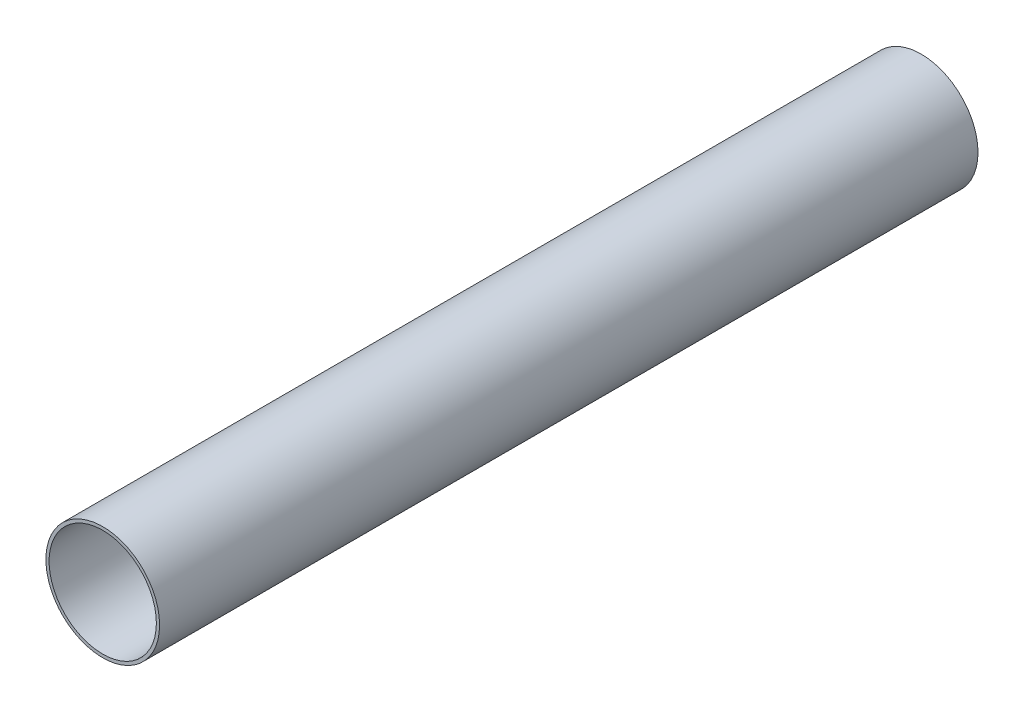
from build123d import *

# Parameters (mm, degrees)
SKETCH1_R           = 31.75
SKETCH1_R_2         = 29.9640625
BOSS_EXTRUDE1_DEPTH = 457.2


with BuildPart() as part:
    # Sketch1 → Boss-Extrude1 (new body)
    with BuildSketch(Plane.XY):
        Circle(SKETCH1_R)
        Circle(SKETCH1_R_2, mode=Mode.SUBTRACT)
    extrude(amount=BOSS_EXTRUDE1_DEPTH)


solid = part.part
